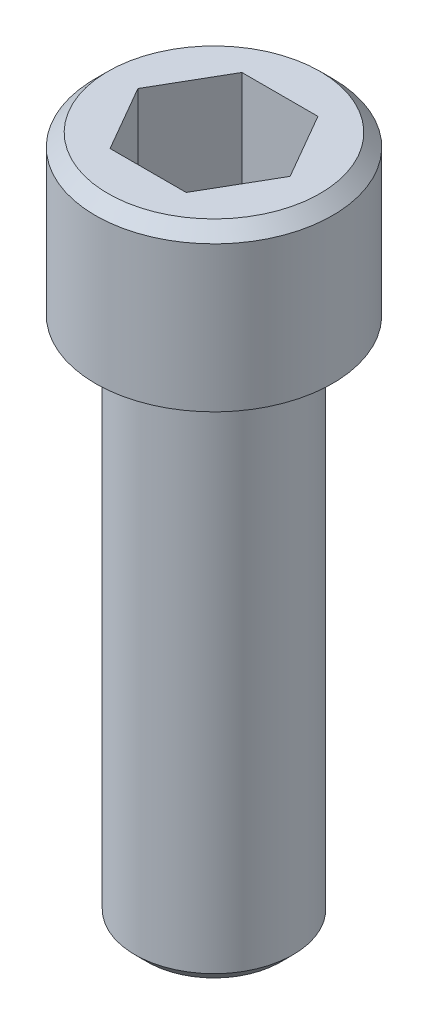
from build123d import *

# Parameters (mm, degrees)
CUT_EXTRUDE1_DEPTH = 6.35
CHAMFER1_SIZE      = 0.762
CHAMFER2_SIZE      = 0.762


with BuildPart() as part:
    # Sketch1 → Base-Revolve (revolve)
    with BuildSketch(Plane.XY, mode=Mode.PRIVATE) as base_revolve_sk:
        Polygon((4.7625, 0), (7.14375, 0), (7.14375, 9.525), (0, 9.525), (0, -31.75), (4.7625, -31.75), align=None)
    revolve(base_revolve_sk.sketch.rotate(Axis((0, 0, 0), (0, 1, 0)), 90), axis=Axis((0, 0, 0), (0, 1, 0)))

    # Sketch2 → Cut-Extrude1 (cut)
    with BuildSketch(Plane(origin=(0, 9.525, 0), x_dir=(-1, 0, 0), z_dir=(0, 1, 0))):
        Polygon((2.291358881, -3.96875), (-2.291358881, -3.96875), (-4.582717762, 0), (-2.291358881, 3.96875), (2.291358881, 3.96875), (4.582717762, 0), align=None)
    extrude(amount=-CUT_EXTRUDE1_DEPTH, mode=Mode.SUBTRACT)

    # Chamfer1
    chamfer1_edges = [part.edges().sort_by_distance(p)[0] for p in [
        (0, 9.525, 7.14375),
    ]]
    chamfer(chamfer1_edges, length=CHAMFER1_SIZE)

    # Chamfer2
    chamfer2_edges = [part.edges().sort_by_distance(p)[0] for p in [
        (0, -31.75, 4.7625),
    ]]
    chamfer(chamfer2_edges, length=CHAMFER2_SIZE)


solid = part.part
